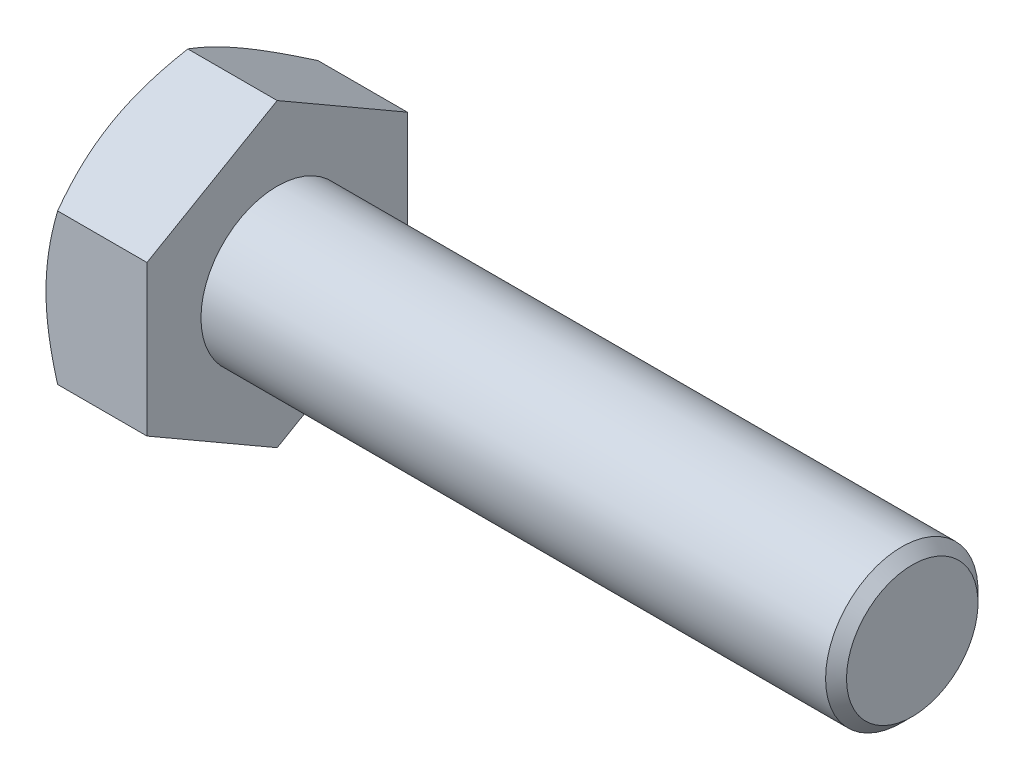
from build123d import *

# Parameters (mm, degrees)
BASEHEAD_DEPTH = 15.9


with BuildPart() as part:
    # Sketch1 → BaseHead (new body)
    with BuildSketch(Plane(origin=(0, 0, 0), x_dir=(0, 0, -1), z_dir=(1, 0, 0))):
        Polygon((20.5, 11.835680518), (20.5, -11.835680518), (0, -23.671361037), (-20.5, -11.835680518), (-20.5, 11.835680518), (0, 23.671361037), align=None)
    extrude(amount=BASEHEAD_DEPTH)

    # BodySke → BaseBody (revolve)
    with BuildSketch(Plane.XY, mode=Mode.PRIVATE) as basebody_sk:
        Polygon((0, 0), (115.9, 0), (115.9, 10.352), (114.252, 12), (0, 12), align=None)
    revolve(basebody_sk.sketch.rotate(Axis((0, 0, 0), (1, 0, 0)), 90), axis=Axis((0, 0, 0), (1, 0, 0)))

    # Sketch3 → HeadChamfer (revolve, cut)
    with BuildSketch(Plane.XY):
        Polygon((0, 20.5), (4.717737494, 28.671361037), (4.717737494, 33.671361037), (-10, 33.671361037), (-10, 20.5), align=None)
    revolve(axis=Axis((0, 0, 0), (1, 0, 0)), mode=Mode.SUBTRACT)


solid = part.part
